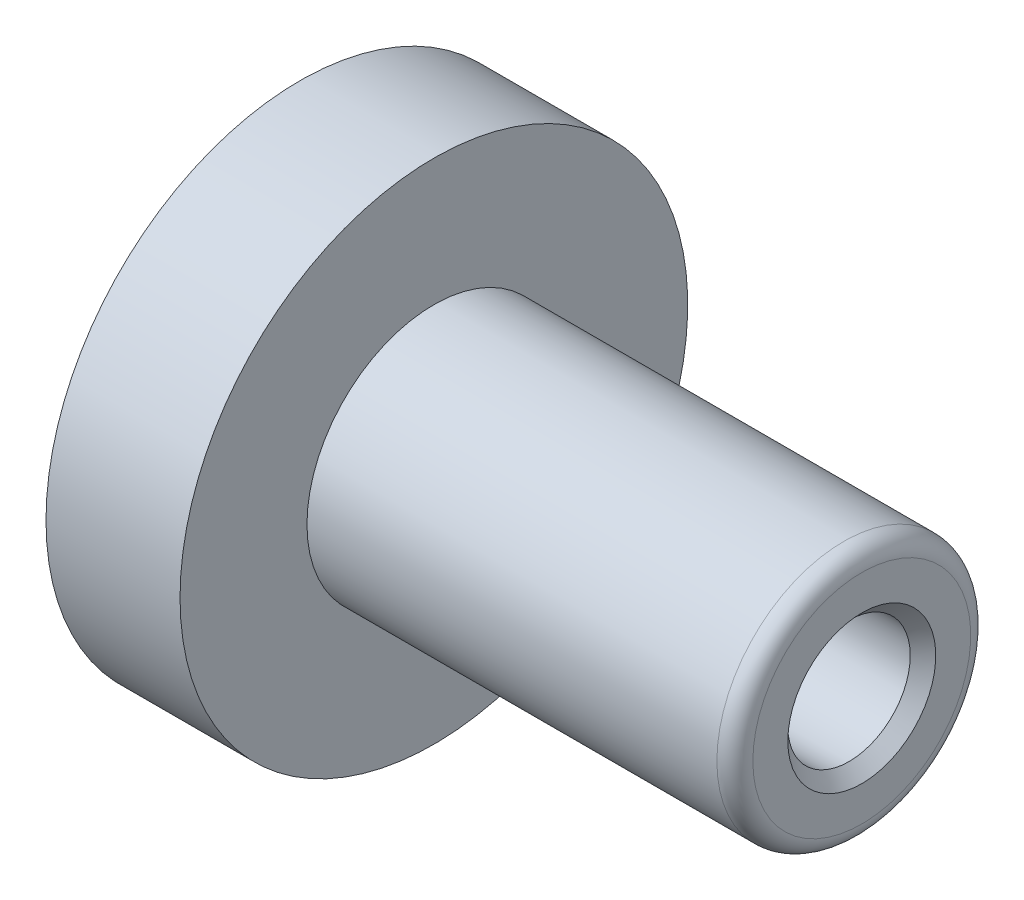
from build123d import *

# Parameters (mm, degrees)
SKETCH2_R          = 3.2004
CUT_EXTRUDE1_DEPTH = 7.9502
SKETCH3_R          = 5.3594
CUT_EXTRUDE2_DEPTH = 18.5674
CHAMFER1_SIZE      = 1.1176


with BuildPart() as part:
    # Sketch1 → Revolve1 (revolve)
    with BuildSketch(Plane.XY, mode=Mode.PRIVATE) as revolve1_sk:
        with BuildLine():
            Line((0, 8.128), (0, 22.225))
            Line((0, 22.225), (11.7348, 22.225))
            Line((11.7348, 22.225), (11.7348, 11.1125))
            Line((11.7348, 11.1125), (47.625, 11.1125))
            ThreePointArc((47.625, 11.1125), (48.738551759, 10.651251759), (49.1998, 9.5377))
            Line((49.1998, 9.5377), (49.1998, 0))
            Line((49.1998, 0), (28.067, 0))
            Line((28.067, 0), (28.067, 8.128))
            Line((28.067, 8.128), (0, 8.128))
        make_face()
    revolve(revolve1_sk.sketch.rotate(Axis((0, 0, 0), (1, 0, 0)), 90), axis=Axis((0, 0, 0), (1, 0, 0)))

    # Sketch2 → Cut-Extrude1 (cut)
    with BuildSketch(Plane.ZY):
        with Locations((0, 12.7)):
            Circle(SKETCH2_R)
        with Locations(Location((0, -12.7, 0), (0, 0, 180))):
            Circle(SKETCH2_R)
    extrude(amount=-CUT_EXTRUDE1_DEPTH, mode=Mode.SUBTRACT)

    # Sketch3 → Cut-Extrude2 (cut)
    with BuildSketch(Plane(origin=(49.1998, 0, 0), x_dir=(0, 0, -1), z_dir=(1, 0, 0))):
        Circle(SKETCH3_R)
    extrude(amount=-CUT_EXTRUDE2_DEPTH, mode=Mode.SUBTRACT)

    # Chamfer1
    chamfer1_edges = [part.edges().sort_by_distance(p)[0] for p in [
        (49.1998, 0, 5.3594),
    ]]
    chamfer(chamfer1_edges, length=CHAMFER1_SIZE)


solid = part.part
